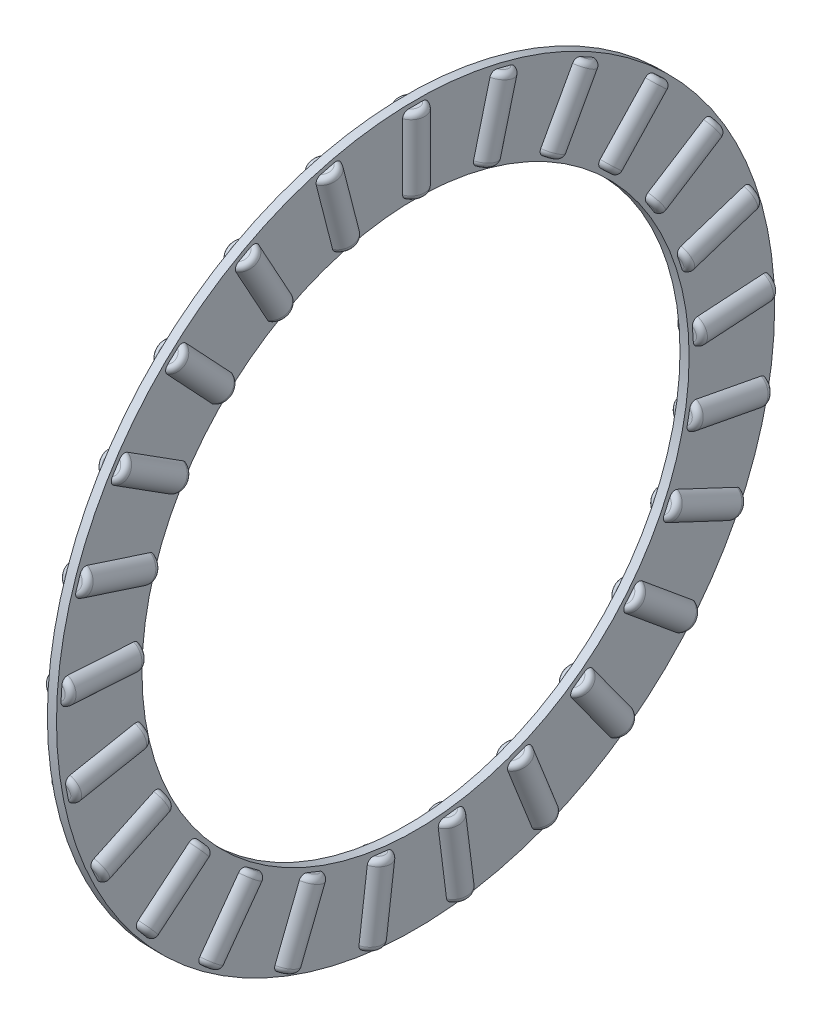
from build123d import *

# Parameters (mm, degrees)
CAGSPISKE_W           = 1.333333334
CAGSPISKE_H           = 12.5
ROLLERSDETAILED_COUNT = 25
ROLLERSDETAILED_ANGLE = 345.6


with BuildPart() as part:
    # CagSpiSke → CageSpine (revolve)
    with BuildSketch(Plane.XY, mode=Mode.PRIVATE) as cagespine_sk:
        with Locations((0, 46.25)):
            Rectangle(CAGSPISKE_W, CAGSPISKE_H)
    revolve(cagespine_sk.sketch.rotate(Axis((-34.925, 0, 0), (1, 0, 0)), 270), axis=Axis((-34.925, 0, 0), (1, 0, 0)))

    # RolDetSke → RollerDetailed (revolve)
    with BuildSketch(Plane.XY):
        with BuildLine():
            Line((0, 51.875), (1.2, 51.875))
            ThreePointArc((1.2, 51.875), (1.765685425, 51.640685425), (2, 51.075))
            Line((2, 51.075), (2, 41.425))
            ThreePointArc((2, 41.425), (1.765685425, 40.859314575), (1.2, 40.625))
            Line((1.2, 40.625), (0, 40.625))
            Line((0, 40.625), (0, 51.875))
        make_face()
    rollerdetailed = revolve(axis=Axis((0, 33.02, 0), (0, 1, 0)))

    # RollersDetailed: RollerDetailed ×25 about axis
    rollersdetailed_axis = Axis((-50, 0, 0), (1, 0, 0))
    for i in range(1, ROLLERSDETAILED_COUNT):
        add(rollerdetailed.rotate(rollersdetailed_axis, i * ROLLERSDETAILED_ANGLE / (ROLLERSDETAILED_COUNT - 1)))


solid = part.part
